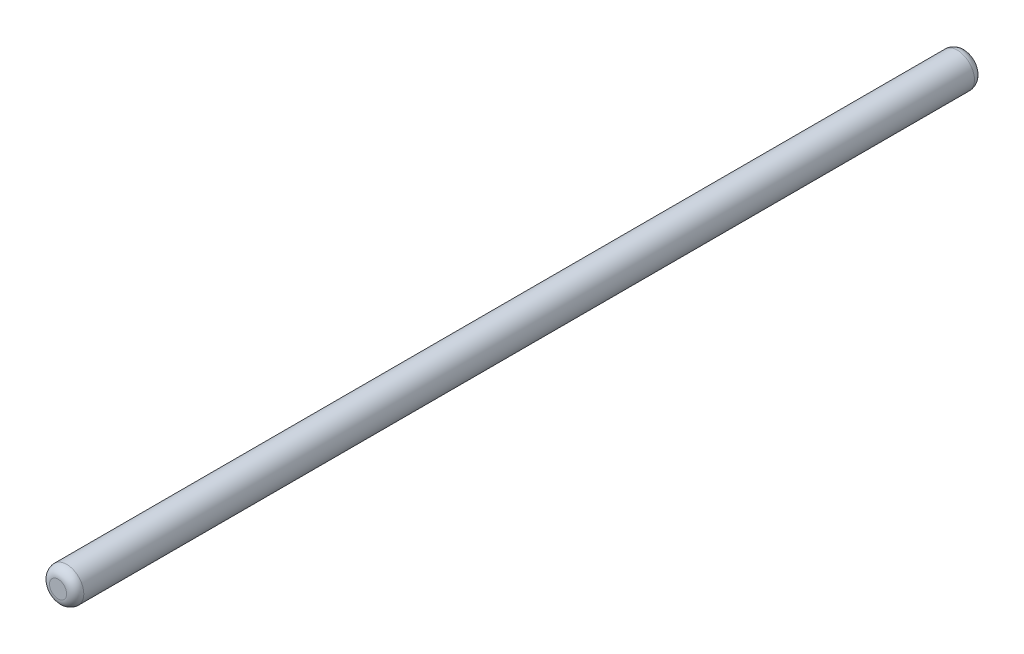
ISO-10303-21;
HEADER;
FILE_DESCRIPTION(('STEP AP214'),'2;1');
FILE_NAME('part.step','',(''),(''),'','','');
FILE_SCHEMA(('AUTOMOTIVE_DESIGN { 1 0 10303 214 1 1 1 1 }'));
ENDSEC;
DATA;
#1=APPLICATION_CONTEXT('core data for automotive mechanical design processes');
#2=APPLICATION_PROTOCOL_DEFINITION('international standard','automotive_design',2000,#1);
#3=PRODUCT_CONTEXT('',#1,'mechanical');
#4=PRODUCT('Part','Part','',(#3));
#5=PRODUCT_RELATED_PRODUCT_CATEGORY('part','',(#4));
#6=PRODUCT_DEFINITION_FORMATION('','',#4);
#7=PRODUCT_DEFINITION_CONTEXT('part definition',#1,'design');
#8=PRODUCT_DEFINITION('design','',#6,#7);
#9=PRODUCT_DEFINITION_SHAPE('','',#8);
#10=(LENGTH_UNIT() NAMED_UNIT(*) SI_UNIT(.MILLI.,.METRE.));
#11=(NAMED_UNIT(*) PLANE_ANGLE_UNIT() SI_UNIT($,.RADIAN.));
#12=(NAMED_UNIT(*) SI_UNIT($,.STERADIAN.) SOLID_ANGLE_UNIT());
#13=UNCERTAINTY_MEASURE_WITH_UNIT(LENGTH_MEASURE(1.E-05),#10,'distance_accuracy_value','');
#14=(GEOMETRIC_REPRESENTATION_CONTEXT(3) GLOBAL_UNCERTAINTY_ASSIGNED_CONTEXT((#13)) GLOBAL_UNIT_ASSIGNED_CONTEXT((#10,
#11,#12)) REPRESENTATION_CONTEXT('',''));
#15=CARTESIAN_POINT('',(0.,0.,0.));
#16=DIRECTION('',(0.,0.,1.));
#17=DIRECTION('',(1.,0.,0.));
#18=AXIS2_PLACEMENT_3D('',#15,#16,#17);
#19=CARTESIAN_POINT('',(0.,0.,106.));
#20=DIRECTION('',(0.,0.,-1.));
#21=DIRECTION('',(-1.,0.,0.));
#22=AXIS2_PLACEMENT_3D('',#19,#20,#21);
#23=CYLINDRICAL_SURFACE('',#22,2.);
#24=CARTESIAN_POINT('',(0.,0.,105.));
#25=DIRECTION('',(0.,0.,1.));
#26=DIRECTION('',(1.,0.,0.));
#27=AXIS2_PLACEMENT_3D('',#24,#25,#26);
#28=CIRCLE('',#27,2.);
#29=CARTESIAN_POINT('',(2.,0.,105.));
#30=VERTEX_POINT('',#29);
#31=EDGE_CURVE('E31',#30,#30,#28,.F.);
#32=ORIENTED_EDGE('',*,*,#31,.T.);
#33=EDGE_LOOP('',(#32));
#34=FACE_BOUND('',#33,.T.);
#35=CARTESIAN_POINT('',(0.,0.,1.));
#36=DIRECTION('',(0.,0.,1.));
#37=DIRECTION('',(1.,0.,0.));
#38=AXIS2_PLACEMENT_3D('',#35,#36,#37);
#39=CIRCLE('',#38,2.);
#40=CARTESIAN_POINT('',(2.,0.,1.));
#41=VERTEX_POINT('',#40);
#42=EDGE_CURVE('E35',#41,#41,#39,.T.);
#43=ORIENTED_EDGE('',*,*,#42,.T.);
#44=EDGE_LOOP('',(#43));
#45=FACE_BOUND('',#44,.T.);
#46=ADVANCED_FACE('F25',(#34,#45),#23,.T.);
#47=CARTESIAN_POINT('',(0.,0.,106.));
#48=DIRECTION('',(0.,0.,1.));
#49=DIRECTION('',(1.,0.,0.));
#50=AXIS2_PLACEMENT_3D('',#47,#48,#49);
#51=PLANE('',#50);
#52=CARTESIAN_POINT('',(0.,0.,106.));
#53=DIRECTION('',(0.,0.,1.));
#54=DIRECTION('',(1.,0.,0.));
#55=AXIS2_PLACEMENT_3D('',#52,#53,#54);
#56=CIRCLE('',#55,0.999999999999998);
#57=CARTESIAN_POINT('',(0.999999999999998,0.,106.));
#58=VERTEX_POINT('',#57);
#59=EDGE_CURVE('E39',#58,#58,#56,.T.);
#60=ORIENTED_EDGE('',*,*,#59,.T.);
#61=EDGE_LOOP('',(#60));
#62=FACE_BOUND('',#61,.T.);
#63=ADVANCED_FACE('F45',(#62),#51,.T.);
#64=CARTESIAN_POINT('',(0.,0.,0.));
#65=DIRECTION('',(0.,0.,1.));
#66=DIRECTION('',(1.,0.,0.));
#67=AXIS2_PLACEMENT_3D('',#64,#65,#66);
#68=PLANE('',#67);
#69=CARTESIAN_POINT('',(0.,0.,0.));
#70=DIRECTION('',(0.,0.,1.));
#71=DIRECTION('',(1.,0.,0.));
#72=AXIS2_PLACEMENT_3D('',#69,#70,#71);
#73=CIRCLE('',#72,0.999999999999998);
#74=CARTESIAN_POINT('',(0.999999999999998,0.,0.));
#75=VERTEX_POINT('',#74);
#76=EDGE_CURVE('E10',#75,#75,#73,.F.);
#77=ORIENTED_EDGE('',*,*,#76,.T.);
#78=EDGE_LOOP('',(#77));
#79=FACE_BOUND('',#78,.T.);
#80=ADVANCED_FACE('F50',(#79),#68,.F.);
#81=CARTESIAN_POINT('',(0.,0.,105.));
#82=DIRECTION('',(0.,0.,1.));
#83=DIRECTION('',(1.,0.,0.));
#84=AXIS2_PLACEMENT_3D('',#81,#82,#83);
#85=DEGENERATE_TOROIDAL_SURFACE('',#84,0.999999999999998,1.,.T.);
#86=ORIENTED_EDGE('',*,*,#31,.F.);
#87=EDGE_LOOP('',(#86));
#88=FACE_BOUND('',#87,.T.);
#89=ORIENTED_EDGE('',*,*,#59,.F.);
#90=EDGE_LOOP('',(#89));
#91=FACE_BOUND('',#90,.T.);
#92=ADVANCED_FACE('F47',(#88,#91),#85,.T.);
#93=CARTESIAN_POINT('',(0.,0.,1.));
#94=DIRECTION('',(0.,0.,1.));
#95=DIRECTION('',(1.,0.,0.));
#96=AXIS2_PLACEMENT_3D('',#93,#94,#95);
#97=DEGENERATE_TOROIDAL_SURFACE('',#96,0.999999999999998,1.,.T.);
#98=ORIENTED_EDGE('',*,*,#76,.F.);
#99=EDGE_LOOP('',(#98));
#100=FACE_BOUND('',#99,.T.);
#101=ORIENTED_EDGE('',*,*,#42,.F.);
#102=EDGE_LOOP('',(#101));
#103=FACE_BOUND('',#102,.T.);
#104=ADVANCED_FACE('F49',(#100,#103),#97,.T.);
#105=CLOSED_SHELL('',(#46,#63,#80,#92,#104));
#106=MANIFOLD_SOLID_BREP('B2',#105);
#107=ADVANCED_BREP_SHAPE_REPRESENTATION('',(#18,#106),#14);
#108=SHAPE_DEFINITION_REPRESENTATION(#9,#107);
ENDSEC;
END-ISO-10303-21;
